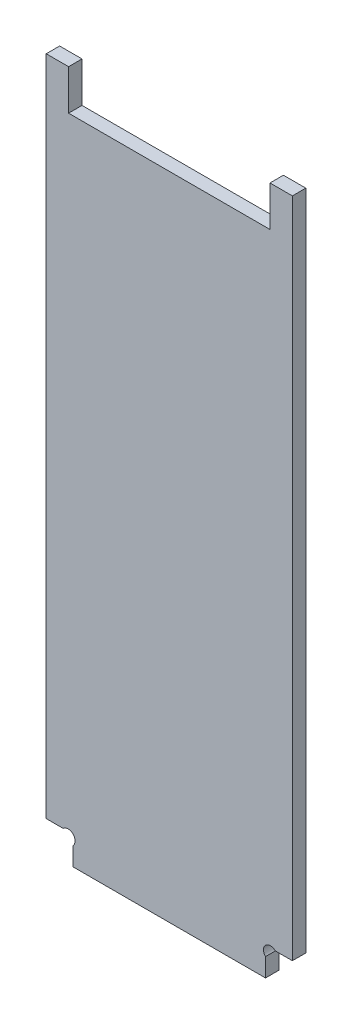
from build123d import *

# Parameters (mm, degrees)
EXTRUSION1_DEPTH = 3


with BuildPart() as part:
    # Esquisse1 → Extrusion1 (new body)
    with BuildSketch(Plane.XY):
        with BuildLine():
            Line((50, 148), (55, 148))
            Line((55, 148), (55, 0))
            Line((55, 0), (51.192031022, 0))
            ThreePointArc((51.192031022, 0), (49, 0), (49, -2.192031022))
            Line((49, -2.192031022), (49, -6.338551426))
            Line((49, -6.338551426), (6, -6.338551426))
            Line((6, -6.338551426), (6, -2.192031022))
            ThreePointArc((6, -2.192031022), (6, 0), (3.807968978, 0))
            Line((3.807968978, 0), (0, 0))
            Line((0, 0), (0, 148))
            Line((0, 148), (5, 148))
            Line((5, 148), (5, 139))
            Line((5, 139), (50, 139))
            Line((50, 139), (50, 148))
        make_face()
    extrude(amount=EXTRUSION1_DEPTH)


solid = part.part
